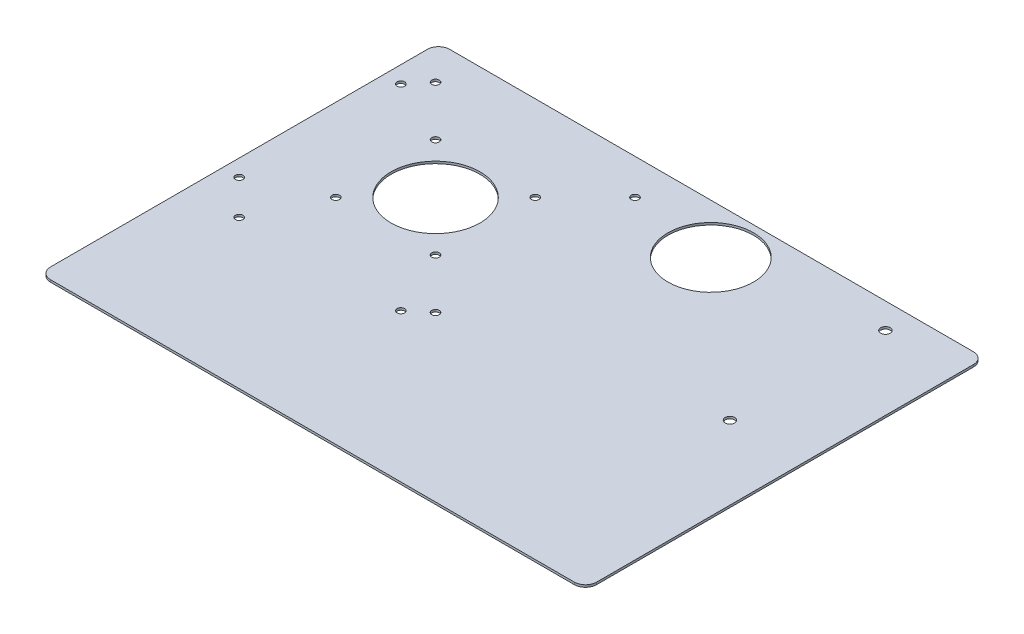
from build123d import *

# Parameters (mm, degrees)
ESQUISSE1_R      = 40
ESQUISSE1_R_2    = 3.4
ESQUISSE1_R_3    = 4.3
ESQUISSE1_R_4    = 38.5
EXTRUSION1_DEPTH = 2


with BuildPart() as part:
    # Esquisse1 → Extrusion1 (new body)
    with BuildSketch(Plane(origin=(0, 0, 0), x_dir=(1, 0, 0), z_dir=(0, 1, 0))):
        with BuildLine():
            Line((-119.1, 111.8), (-119.1, -227.5))
            ThreePointArc((-119.1, -227.5), (-116.171067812, -234.571067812), (-109.1, -237.5))
            Line((-109.1, -237.5), (362.5, -237.5))
            ThreePointArc((362.5, -237.5), (369.571067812, -234.571067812), (372.5, -227.5))
            Line((372.5, -227.5), (372.5, 111.8))
            ThreePointArc((372.5, 111.8), (369.571067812, 118.871067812), (362.5, 121.8))
            Line((362.5, 121.8), (-109.1, 121.8))
            ThreePointArc((-109.1, 121.8), (-116.171067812, 118.871067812), (-119.1, 111.8))
        make_face()
        with Locations(Location((0, 0, 0), (0, 0, 270))):
            Circle(ESQUISSE1_R, mode=Mode.SUBTRACT)
        with Locations(Location((-104, 72.8, 0), (0, 0, 270))):
            Circle(ESQUISSE1_R_2, mode=Mode.SUBTRACT)
        with Locations(Location((-89.8, 89.8, 0), (0, 0, 270))):
            Circle(ESQUISSE1_R_2, mode=Mode.SUBTRACT)
        with Locations(Location((-44.9, 44.9, 0), (0, 0, 270))):
            Circle(ESQUISSE1_R_2, mode=Mode.SUBTRACT)
        with Locations(Location((44.9, 44.9, 0), (0, 0, 270))):
            Circle(ESQUISSE1_R_2, mode=Mode.SUBTRACT)
        with Locations(Location((44.9, -44.9, 0), (0, 0, 270))):
            Circle(ESQUISSE1_R_2, mode=Mode.SUBTRACT)
        with Locations(Location((-44.9, -44.9, 0), (0, 0, 270))):
            Circle(ESQUISSE1_R_2, mode=Mode.SUBTRACT)
        with Locations(Location((-104, -72.8, 0), (0, 0, 270))):
            Circle(ESQUISSE1_R_2, mode=Mode.SUBTRACT)
        with Locations(Location((-72.8, -104, 0), (0, 0, 270))):
            Circle(ESQUISSE1_R_2, mode=Mode.SUBTRACT)
        with Locations(Location((72.8, -104, 0), (0, 0, 270))):
            Circle(ESQUISSE1_R_2, mode=Mode.SUBTRACT)
        with Locations(Location((89.8, -89.8, 0), (0, 0, 270))):
            Circle(ESQUISSE1_R_2, mode=Mode.SUBTRACT)
        with Locations(Location((89.8, 89.8, 0), (0, 0, 270))):
            Circle(ESQUISSE1_R_2, mode=Mode.SUBTRACT)
        with Locations(Location((306.3, 98.8, 0), (0, 0, 270))):
            Circle(ESQUISSE1_R_3, mode=Mode.SUBTRACT)
        with Locations(Location((306.3, -41.2, 0), (0, 0, 270))):
            Circle(ESQUISSE1_R_3, mode=Mode.SUBTRACT)
        with Locations(Location((170.7, 77.1, 0), (0, 0, 270))):
            Circle(ESQUISSE1_R_4, mode=Mode.SUBTRACT)
    extrude(amount=EXTRUSION1_DEPTH)


solid = part.part
